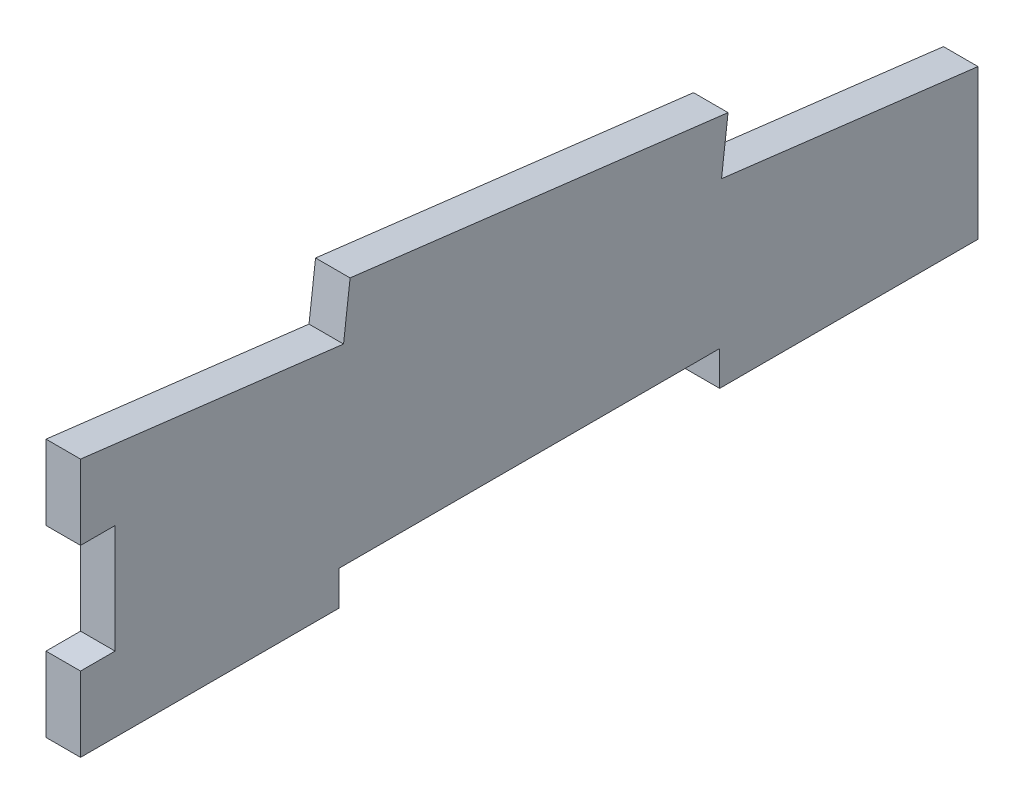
from build123d import *

# Parameters (mm, degrees)
BOSS_EXTRUDE1_DEPTH = 6.35


with BuildPart() as part:
    # Sketch1 → Boss-Extrude1 (new body)
    with BuildSketch(Plane(origin=(0, 0, 0), x_dir=(0, 0, -1), z_dir=(1, 0, 0))):
        Polygon((-127.91381822, -22.333333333), (-127.91381822, -36.083333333), (-121.56381822, -36.083333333), (-121.56381822, -56.083333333), (-127.91381822, -56.083333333), (-127.91381822, -69.833333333), (-80.41381822, -69.833333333), (-80.41381822, -63.483333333), (-10.41381822, -63.483333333), (-10.41381822, -69.833333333), (37.08618178, -69.833333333), (37.08618178, -42.333333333), (-10.068672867, -36.617593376), (-8.865359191, -26.690255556), (-78.356723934, -18.267059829), (-79.560037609, -28.19439765), align=None)
    extrude(amount=BOSS_EXTRUDE1_DEPTH)


solid = part.part
